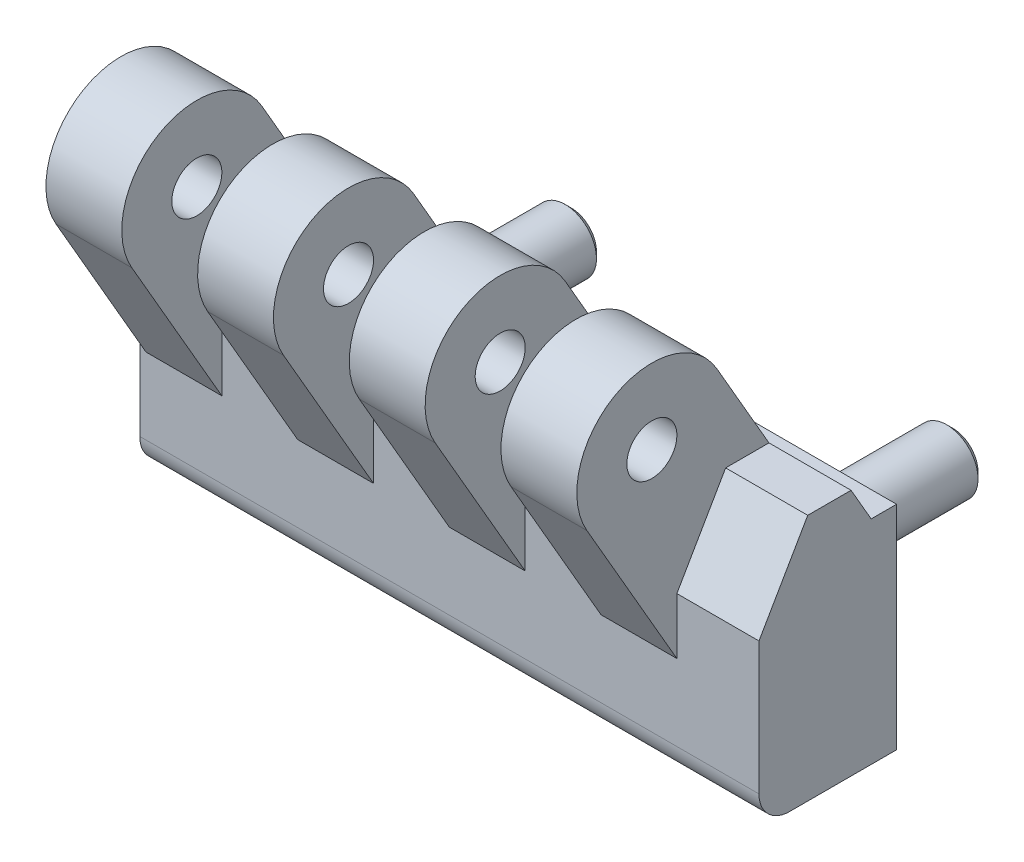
ISO-10303-21;
HEADER;
FILE_DESCRIPTION(('STEP AP214'),'2;1');
FILE_NAME('part.step','',(''),(''),'','','');
FILE_SCHEMA(('AUTOMOTIVE_DESIGN { 1 0 10303 214 1 1 1 1 }'));
ENDSEC;
DATA;
#1=APPLICATION_CONTEXT('core data for automotive mechanical design processes');
#2=APPLICATION_PROTOCOL_DEFINITION('international standard','automotive_design',2000,#1);
#3=PRODUCT_CONTEXT('',#1,'mechanical');
#4=PRODUCT('Part','Part','',(#3));
#5=PRODUCT_RELATED_PRODUCT_CATEGORY('part','',(#4));
#6=PRODUCT_DEFINITION_FORMATION('','',#4);
#7=PRODUCT_DEFINITION_CONTEXT('part definition',#1,'design');
#8=PRODUCT_DEFINITION('design','',#6,#7);
#9=PRODUCT_DEFINITION_SHAPE('','',#8);
#10=(LENGTH_UNIT() NAMED_UNIT(*) SI_UNIT(.MILLI.,.METRE.));
#11=(NAMED_UNIT(*) PLANE_ANGLE_UNIT() SI_UNIT($,.RADIAN.));
#12=(NAMED_UNIT(*) SI_UNIT($,.STERADIAN.) SOLID_ANGLE_UNIT());
#13=UNCERTAINTY_MEASURE_WITH_UNIT(LENGTH_MEASURE(1.E-05),#10,'distance_accuracy_value','');
#14=(GEOMETRIC_REPRESENTATION_CONTEXT(3) GLOBAL_UNCERTAINTY_ASSIGNED_CONTEXT((#13)) GLOBAL_UNIT_ASSIGNED_CONTEXT((#10,
#11,#12)) REPRESENTATION_CONTEXT('',''));
#15=CARTESIAN_POINT('',(0.,0.,0.));
#16=DIRECTION('',(0.,0.,1.));
#17=DIRECTION('',(1.,0.,0.));
#18=AXIS2_PLACEMENT_3D('',#15,#16,#17);
#19=CARTESIAN_POINT('',(-9.5,11.2857142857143,3.6386777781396));
#20=DIRECTION('',(0.,1.,0.));
#21=DIRECTION('',(-1.,0.,0.));
#22=AXIS2_PLACEMENT_3D('',#19,#20,#21);
#23=PLANE('',#22);
#24=DIRECTION('',(1.,0.,0.));
#25=VECTOR('',#24,1.);
#26=CARTESIAN_POINT('',(-9.5,11.2857142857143,7.1027793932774));
#27=LINE('',#26,#25);
#28=CARTESIAN_POINT('',(21.3125,11.2857142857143,7.1027793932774));
#29=VERTEX_POINT('',#28);
#30=CARTESIAN_POINT('',(27.375,11.2857142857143,7.1027793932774));
#31=VERTEX_POINT('',#30);
#32=EDGE_CURVE('E471',#29,#31,#27,.T.);
#33=ORIENTED_EDGE('',*,*,#32,.T.);
#34=DIRECTION('',(0.,0.,-1.));
#35=VECTOR('',#34,1.);
#36=CARTESIAN_POINT('',(27.375,11.2857142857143,3.6386777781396));
#37=LINE('',#36,#35);
#38=CARTESIAN_POINT('',(27.375,11.2857142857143,3.63867777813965));
#39=VERTEX_POINT('',#38);
#40=EDGE_CURVE('E29',#31,#39,#37,.T.);
#41=ORIENTED_EDGE('',*,*,#40,.T.);
#42=DIRECTION('',(1.,0.,0.));
#43=VECTOR('',#42,1.);
#44=CARTESIAN_POINT('',(-9.5,11.2857142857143,3.6386777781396));
#45=LINE('',#44,#43);
#46=CARTESIAN_POINT('',(21.3125,11.2857142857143,3.63867777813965));
#47=VERTEX_POINT('',#46);
#48=EDGE_CURVE('E232',#47,#39,#45,.T.);
#49=ORIENTED_EDGE('',*,*,#48,.F.);
#50=DIRECTION('',(0.,0.,-1.));
#51=VECTOR('',#50,1.);
#52=CARTESIAN_POINT('',(21.3125,11.2857142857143,3.6386777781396));
#53=LINE('',#52,#51);
#54=EDGE_CURVE('E405',#29,#47,#53,.T.);
#55=ORIENTED_EDGE('',*,*,#54,.F.);
#56=EDGE_LOOP('',(#33,#41,#49,#55));
#57=FACE_BOUND('',#56,.T.);
#58=ADVANCED_FACE('F14',(#57),#23,.T.);
#59=CARTESIAN_POINT('',(-9.5,11.2857142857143,7.1027793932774));
#60=DIRECTION('',(0.,0.49999999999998,0.86602540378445));
#61=DIRECTION('',(0.,-0.86602540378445,0.499999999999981));
#62=AXIS2_PLACEMENT_3D('',#59,#60,#61);
#63=PLANE('',#62);
#64=DIRECTION('',(1.,0.,0.));
#65=VECTOR('',#64,1.);
#66=CARTESIAN_POINT('',(-9.5,4.535530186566,11.));
#67=LINE('',#66,#65);
#68=CARTESIAN_POINT('',(21.3125,4.535530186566,11.));
#69=VERTEX_POINT('',#68);
#70=CARTESIAN_POINT('',(27.375,4.535530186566,11.));
#71=VERTEX_POINT('',#70);
#72=EDGE_CURVE('E465',#69,#71,#67,.T.);
#73=ORIENTED_EDGE('',*,*,#72,.T.);
#74=DIRECTION('',(0.,0.86602540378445,-0.499999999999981));
#75=VECTOR('',#74,1.);
#76=CARTESIAN_POINT('',(27.375,11.2857142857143,7.1027793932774));
#77=LINE('',#76,#75);
#78=EDGE_CURVE('E502',#71,#31,#77,.T.);
#79=ORIENTED_EDGE('',*,*,#78,.T.);
#80=ORIENTED_EDGE('',*,*,#32,.F.);
#81=DIRECTION('',(0.,0.86602540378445,-0.499999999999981));
#82=VECTOR('',#81,1.);
#83=CARTESIAN_POINT('',(21.3125,11.2857142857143,7.1027793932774));
#84=LINE('',#83,#82);
#85=EDGE_CURVE('E403',#69,#29,#84,.T.);
#86=ORIENTED_EDGE('',*,*,#85,.F.);
#87=EDGE_LOOP('',(#73,#79,#80,#86));
#88=FACE_BOUND('',#87,.T.);
#89=ADVANCED_FACE('F630',(#88),#63,.T.);
#90=CARTESIAN_POINT('',(-9.5,11.2857142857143,7.1027793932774));
#91=VERTEX_POINT('',#90);
#92=CARTESIAN_POINT('',(-9.,11.2857142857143,7.1027793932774));
#93=VERTEX_POINT('',#92);
#94=EDGE_CURVE('E466',#91,#93,#27,.T.);
#95=ORIENTED_EDGE('',*,*,#94,.T.);
#96=DIRECTION('',(0.,0.,-1.));
#97=VECTOR('',#96,1.);
#98=CARTESIAN_POINT('',(-9.,11.2857142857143,3.6386777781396));
#99=LINE('',#98,#97);
#100=CARTESIAN_POINT('',(-9.,11.2857142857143,3.6386777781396));
#101=VERTEX_POINT('',#100);
#102=EDGE_CURVE('E322',#93,#101,#99,.T.);
#103=ORIENTED_EDGE('',*,*,#102,.T.);
#104=CARTESIAN_POINT('',(-9.5,11.2857142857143,3.6386777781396));
#105=VERTEX_POINT('',#104);
#106=EDGE_CURVE('E472',#105,#101,#45,.T.);
#107=ORIENTED_EDGE('',*,*,#106,.F.);
#108=DIRECTION('',(0.,0.,1.));
#109=VECTOR('',#108,1.);
#110=CARTESIAN_POINT('',(-9.5,11.2857142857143,3.6386777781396));
#111=LINE('',#110,#109);
#112=EDGE_CURVE('E441',#105,#91,#111,.T.);
#113=ORIENTED_EDGE('',*,*,#112,.T.);
#114=EDGE_LOOP('',(#95,#103,#107,#113));
#115=FACE_BOUND('',#114,.T.);
#116=ADVANCED_FACE('F574',(#115),#23,.T.);
#117=CARTESIAN_POINT('',(-9.5,4.535530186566,11.));
#118=VERTEX_POINT('',#117);
#119=CARTESIAN_POINT('',(-9.,4.535530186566,11.));
#120=VERTEX_POINT('',#119);
#121=EDGE_CURVE('E460',#118,#120,#67,.T.);
#122=ORIENTED_EDGE('',*,*,#121,.T.);
#123=DIRECTION('',(0.,0.86602540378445,-0.499999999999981));
#124=VECTOR('',#123,1.);
#125=CARTESIAN_POINT('',(-9.,11.2857142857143,7.1027793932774));
#126=LINE('',#125,#124);
#127=EDGE_CURVE('E320',#120,#93,#126,.T.);
#128=ORIENTED_EDGE('',*,*,#127,.T.);
#129=ORIENTED_EDGE('',*,*,#94,.F.);
#130=DIRECTION('',(0.,-0.86602540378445,0.49999999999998));
#131=VECTOR('',#130,1.);
#132=CARTESIAN_POINT('',(-9.5,11.2857142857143,7.1027793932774));
#133=LINE('',#132,#131);
#134=EDGE_CURVE('E444',#91,#118,#133,.T.);
#135=ORIENTED_EDGE('',*,*,#134,.T.);
#136=EDGE_LOOP('',(#122,#128,#129,#135));
#137=FACE_BOUND('',#136,.T.);
#138=ADVANCED_FACE('F638',(#137),#63,.T.);
#139=CARTESIAN_POINT('',(-9.5,4.535530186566,11.));
#140=DIRECTION('',(0.,0.,1.));
#141=DIRECTION('',(1.,0.,0.));
#142=AXIS2_PLACEMENT_3D('',#139,#140,#141);
#143=PLANE('',#142);
#144=DIRECTION('',(0.,1.,0.));
#145=VECTOR('',#144,1.);
#146=CARTESIAN_POINT('',(33.4375,4.535530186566,11.));
#147=LINE('',#146,#145);
#148=CARTESIAN_POINT('',(33.4375,0.0358983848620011,11.));
#149=VERTEX_POINT('',#148);
#150=CARTESIAN_POINT('',(33.4375,4.535530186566,11.));
#151=VERTEX_POINT('',#150);
#152=EDGE_CURVE('E278',#149,#151,#147,.T.);
#153=ORIENTED_EDGE('',*,*,#152,.F.);
#154=DIRECTION('',(-1.,0.,0.));
#155=VECTOR('',#154,1.);
#156=CARTESIAN_POINT('',(-9.5,0.0358983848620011,11.));
#157=LINE('',#156,#155);
#158=CARTESIAN_POINT('',(27.375,0.0358983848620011,11.));
#159=VERTEX_POINT('',#158);
#160=EDGE_CURVE('E506',#149,#159,#157,.T.);
#161=ORIENTED_EDGE('',*,*,#160,.T.);
#162=DIRECTION('',(0.,1.,0.));
#163=VECTOR('',#162,1.);
#164=CARTESIAN_POINT('',(27.375,4.535530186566,11.));
#165=LINE('',#164,#163);
#166=EDGE_CURVE('E273',#159,#71,#165,.T.);
#167=ORIENTED_EDGE('',*,*,#166,.T.);
#168=ORIENTED_EDGE('',*,*,#72,.F.);
#169=DIRECTION('',(0.,1.,0.));
#170=VECTOR('',#169,1.);
#171=CARTESIAN_POINT('',(21.3125,4.535530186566,11.));
#172=LINE('',#171,#170);
#173=CARTESIAN_POINT('',(21.3125,0.0358983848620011,11.));
#174=VERTEX_POINT('',#173);
#175=EDGE_CURVE('E488',#174,#69,#172,.T.);
#176=ORIENTED_EDGE('',*,*,#175,.F.);
#177=DIRECTION('',(-1.,0.,0.));
#178=VECTOR('',#177,1.);
#179=CARTESIAN_POINT('',(-9.5,0.0358983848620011,11.));
#180=LINE('',#179,#178);
#181=CARTESIAN_POINT('',(15.25,0.0358983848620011,11.));
#182=VERTEX_POINT('',#181);
#183=EDGE_CURVE('E485',#174,#182,#180,.T.);
#184=ORIENTED_EDGE('',*,*,#183,.T.);
#185=DIRECTION('',(0.,1.,0.));
#186=VECTOR('',#185,1.);
#187=CARTESIAN_POINT('',(15.25,4.535530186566,11.));
#188=LINE('',#187,#186);
#189=CARTESIAN_POINT('',(15.25,4.535530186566,11.));
#190=VERTEX_POINT('',#189);
#191=EDGE_CURVE('E482',#182,#190,#188,.T.);
#192=ORIENTED_EDGE('',*,*,#191,.T.);
#193=CARTESIAN_POINT('',(9.1875,4.535530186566,11.));
#194=VERTEX_POINT('',#193);
#195=EDGE_CURVE('E552',#194,#190,#67,.T.);
#196=ORIENTED_EDGE('',*,*,#195,.F.);
#197=DIRECTION('',(0.,1.,0.));
#198=VECTOR('',#197,1.);
#199=CARTESIAN_POINT('',(9.1875,4.535530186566,11.));
#200=LINE('',#199,#198);
#201=CARTESIAN_POINT('',(9.1875,0.0358983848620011,11.));
#202=VERTEX_POINT('',#201);
#203=EDGE_CURVE('E490',#202,#194,#200,.T.);
#204=ORIENTED_EDGE('',*,*,#203,.F.);
#205=DIRECTION('',(1.,0.,0.));
#206=VECTOR('',#205,1.);
#207=CARTESIAN_POINT('',(-9.5,0.0358983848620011,11.));
#208=LINE('',#207,#206);
#209=CARTESIAN_POINT('',(3.125,0.0358983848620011,11.));
#210=VERTEX_POINT('',#209);
#211=EDGE_CURVE('E493',#210,#202,#208,.T.);
#212=ORIENTED_EDGE('',*,*,#211,.F.);
#213=DIRECTION('',(0.,1.,0.));
#214=VECTOR('',#213,1.);
#215=CARTESIAN_POINT('',(3.125,4.535530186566,11.));
#216=LINE('',#215,#214);
#217=CARTESIAN_POINT('',(3.125,4.535530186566,11.));
#218=VERTEX_POINT('',#217);
#219=EDGE_CURVE('E496',#210,#218,#216,.T.);
#220=ORIENTED_EDGE('',*,*,#219,.T.);
#221=CARTESIAN_POINT('',(-2.9375,4.535530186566,11.));
#222=VERTEX_POINT('',#221);
#223=EDGE_CURVE('E464',#222,#218,#67,.T.);
#224=ORIENTED_EDGE('',*,*,#223,.F.);
#225=DIRECTION('',(0.,1.,0.));
#226=VECTOR('',#225,1.);
#227=CARTESIAN_POINT('',(-2.9375,4.535530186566,11.));
#228=LINE('',#227,#226);
#229=CARTESIAN_POINT('',(-2.9375,0.0358983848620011,11.));
#230=VERTEX_POINT('',#229);
#231=EDGE_CURVE('E311',#230,#222,#228,.T.);
#232=ORIENTED_EDGE('',*,*,#231,.F.);
#233=DIRECTION('',(1.,0.,0.));
#234=VECTOR('',#233,1.);
#235=CARTESIAN_POINT('',(-9.5,0.0358983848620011,11.));
#236=LINE('',#235,#234);
#237=CARTESIAN_POINT('',(-9.,0.0358983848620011,11.));
#238=VERTEX_POINT('',#237);
#239=EDGE_CURVE('E499',#238,#230,#236,.T.);
#240=ORIENTED_EDGE('',*,*,#239,.F.);
#241=DIRECTION('',(0.,1.,0.));
#242=VECTOR('',#241,1.);
#243=CARTESIAN_POINT('',(-9.,4.535530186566,11.));
#244=LINE('',#243,#242);
#245=EDGE_CURVE('E318',#238,#120,#244,.T.);
#246=ORIENTED_EDGE('',*,*,#245,.T.);
#247=ORIENTED_EDGE('',*,*,#121,.F.);
#248=DIRECTION('',(0.,-1.,0.));
#249=VECTOR('',#248,1.);
#250=CARTESIAN_POINT('',(-9.5,4.535530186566,11.));
#251=LINE('',#250,#249);
#252=CARTESIAN_POINT('',(-9.5,-6.055555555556,11.));
#253=VERTEX_POINT('',#252);
#254=EDGE_CURVE('E447',#118,#253,#251,.T.);
#255=ORIENTED_EDGE('',*,*,#254,.T.);
#256=DIRECTION('',(1.,0.,0.));
#257=VECTOR('',#256,1.);
#258=CARTESIAN_POINT('',(-9.5,-6.055555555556,11.));
#259=LINE('',#258,#257);
#260=CARTESIAN_POINT('',(40.,-6.055555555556,11.));
#261=VERTEX_POINT('',#260);
#262=EDGE_CURVE('E457',#253,#261,#259,.T.);
#263=ORIENTED_EDGE('',*,*,#262,.T.);
#264=DIRECTION('',(0.,-1.,0.));
#265=VECTOR('',#264,1.);
#266=CARTESIAN_POINT('',(40.,4.535530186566,11.));
#267=LINE('',#266,#265);
#268=CARTESIAN_POINT('',(40.,4.535530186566,11.));
#269=VERTEX_POINT('',#268);
#270=EDGE_CURVE('E423',#269,#261,#267,.T.);
#271=ORIENTED_EDGE('',*,*,#270,.F.);
#272=EDGE_CURVE('E459',#151,#269,#67,.T.);
#273=ORIENTED_EDGE('',*,*,#272,.F.);
#274=EDGE_LOOP('',(#153,#161,#167,#168,#176,#184,#192,#196,#204,#212,#220,#224,#232,#240,#246,
#247,#255,#263,#271,#273));
#275=FACE_BOUND('',#274,.T.);
#276=ADVANCED_FACE('F563',(#275),#143,.T.);
#277=DIRECTION('',(0.,0.,-1.));
#278=VECTOR('',#277,1.);
#279=CARTESIAN_POINT('',(-2.9375,11.2857142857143,3.6386777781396));
#280=LINE('',#279,#278);
#281=CARTESIAN_POINT('',(-2.9375,11.2857142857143,7.1027793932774));
#282=VERTEX_POINT('',#281);
#283=CARTESIAN_POINT('',(-2.9375,11.2857142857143,3.6386777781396));
#284=VERTEX_POINT('',#283);
#285=EDGE_CURVE('E37',#282,#284,#280,.T.);
#286=ORIENTED_EDGE('',*,*,#285,.F.);
#287=CARTESIAN_POINT('',(3.125,11.2857142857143,7.1027793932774));
#288=VERTEX_POINT('',#287);
#289=EDGE_CURVE('E470',#282,#288,#27,.T.);
#290=ORIENTED_EDGE('',*,*,#289,.T.);
#291=DIRECTION('',(0.,0.,-1.));
#292=VECTOR('',#291,1.);
#293=CARTESIAN_POINT('',(3.125,11.2857142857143,3.6386777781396));
#294=LINE('',#293,#292);
#295=CARTESIAN_POINT('',(3.125,11.2857142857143,3.6386777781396));
#296=VERTEX_POINT('',#295);
#297=EDGE_CURVE('E364',#288,#296,#294,.T.);
#298=ORIENTED_EDGE('',*,*,#297,.T.);
#299=EDGE_CURVE('E476',#284,#296,#45,.T.);
#300=ORIENTED_EDGE('',*,*,#299,.F.);
#301=EDGE_LOOP('',(#286,#290,#298,#300));
#302=FACE_BOUND('',#301,.T.);
#303=ADVANCED_FACE('F603',(#302),#23,.T.);
#304=DIRECTION('',(0.,0.86602540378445,-0.499999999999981));
#305=VECTOR('',#304,1.);
#306=CARTESIAN_POINT('',(-2.9375,11.2857142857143,7.1027793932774));
#307=LINE('',#306,#305);
#308=EDGE_CURVE('E314',#222,#282,#307,.T.);
#309=ORIENTED_EDGE('',*,*,#308,.F.);
#310=ORIENTED_EDGE('',*,*,#223,.T.);
#311=DIRECTION('',(0.,0.86602540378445,-0.499999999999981));
#312=VECTOR('',#311,1.);
#313=CARTESIAN_POINT('',(3.125,11.2857142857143,7.1027793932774));
#314=LINE('',#313,#312);
#315=EDGE_CURVE('E361',#218,#288,#314,.T.);
#316=ORIENTED_EDGE('',*,*,#315,.T.);
#317=ORIENTED_EDGE('',*,*,#289,.F.);
#318=EDGE_LOOP('',(#309,#310,#316,#317));
#319=FACE_BOUND('',#318,.T.);
#320=ADVANCED_FACE('F594',(#319),#63,.T.);
#321=DIRECTION('',(0.,0.,-1.));
#322=VECTOR('',#321,1.);
#323=CARTESIAN_POINT('',(9.1875,11.2857142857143,3.6386777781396));
#324=LINE('',#323,#322);
#325=CARTESIAN_POINT('',(9.1875,11.2857142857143,7.1027793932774));
#326=VERTEX_POINT('',#325);
#327=CARTESIAN_POINT('',(9.1875,11.2857142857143,3.6386777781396));
#328=VERTEX_POINT('',#327);
#329=EDGE_CURVE('E358',#326,#328,#324,.T.);
#330=ORIENTED_EDGE('',*,*,#329,.F.);
#331=CARTESIAN_POINT('',(15.25,11.2857142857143,7.1027793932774));
#332=VERTEX_POINT('',#331);
#333=EDGE_CURVE('E538',#326,#332,#27,.T.);
#334=ORIENTED_EDGE('',*,*,#333,.T.);
#335=DIRECTION('',(0.,0.,-1.));
#336=VECTOR('',#335,1.);
#337=CARTESIAN_POINT('',(15.25,11.2857142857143,3.6386777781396));
#338=LINE('',#337,#336);
#339=CARTESIAN_POINT('',(15.25,11.2857142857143,3.63867777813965));
#340=VERTEX_POINT('',#339);
#341=EDGE_CURVE('E400',#332,#340,#338,.T.);
#342=ORIENTED_EDGE('',*,*,#341,.T.);
#343=EDGE_CURVE('E604',#328,#340,#45,.T.);
#344=ORIENTED_EDGE('',*,*,#343,.F.);
#345=EDGE_LOOP('',(#330,#334,#342,#344));
#346=FACE_BOUND('',#345,.T.);
#347=ADVANCED_FACE('F542',(#346),#23,.T.);
#348=DIRECTION('',(0.,0.86602540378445,-0.499999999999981));
#349=VECTOR('',#348,1.);
#350=CARTESIAN_POINT('',(9.1875,11.2857142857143,7.1027793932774));
#351=LINE('',#350,#349);
#352=EDGE_CURVE('E355',#194,#326,#351,.T.);
#353=ORIENTED_EDGE('',*,*,#352,.F.);
#354=ORIENTED_EDGE('',*,*,#195,.T.);
#355=DIRECTION('',(0.,0.86602540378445,-0.499999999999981));
#356=VECTOR('',#355,1.);
#357=CARTESIAN_POINT('',(15.25,11.2857142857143,7.1027793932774));
#358=LINE('',#357,#356);
#359=EDGE_CURVE('E397',#190,#332,#358,.T.);
#360=ORIENTED_EDGE('',*,*,#359,.T.);
#361=ORIENTED_EDGE('',*,*,#333,.F.);
#362=EDGE_LOOP('',(#353,#354,#360,#361));
#363=FACE_BOUND('',#362,.T.);
#364=ADVANCED_FACE('F551',(#363),#63,.T.);
#365=CARTESIAN_POINT('',(-9.5,-8.5,8.5555555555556));
#366=DIRECTION('',(0.,-1.,0.));
#367=DIRECTION('',(1.,0.,0.));
#368=AXIS2_PLACEMENT_3D('',#365,#366,#367);
#369=PLANE('',#368);
#370=DIRECTION('',(1.,0.,0.));
#371=VECTOR('',#370,1.);
#372=CARTESIAN_POINT('',(-9.5,-8.5,0.));
#373=LINE('',#372,#371);
#374=CARTESIAN_POINT('',(-9.5,-8.5,0.));
#375=VERTEX_POINT('',#374);
#376=CARTESIAN_POINT('',(40.,-8.5,0.));
#377=VERTEX_POINT('',#376);
#378=EDGE_CURVE('E480',#375,#377,#373,.T.);
#379=ORIENTED_EDGE('',*,*,#378,.T.);
#380=DIRECTION('',(0.,0.,-1.));
#381=VECTOR('',#380,1.);
#382=CARTESIAN_POINT('',(40.,-8.5,8.5555555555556));
#383=LINE('',#382,#381);
#384=CARTESIAN_POINT('',(40.,-8.5,8.5555555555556));
#385=VERTEX_POINT('',#384);
#386=EDGE_CURVE('E407',#385,#377,#383,.T.);
#387=ORIENTED_EDGE('',*,*,#386,.F.);
#388=DIRECTION('',(1.,0.,0.));
#389=VECTOR('',#388,1.);
#390=CARTESIAN_POINT('',(-9.5,-8.5,8.5555555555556));
#391=LINE('',#390,#389);
#392=CARTESIAN_POINT('',(-9.5,-8.5,8.5555555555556));
#393=VERTEX_POINT('',#392);
#394=EDGE_CURVE('E453',#393,#385,#391,.T.);
#395=ORIENTED_EDGE('',*,*,#394,.F.);
#396=DIRECTION('',(0.,0.,-1.));
#397=VECTOR('',#396,1.);
#398=CARTESIAN_POINT('',(-9.5,-8.5,8.5555555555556));
#399=LINE('',#398,#397);
#400=EDGE_CURVE('E429',#393,#375,#399,.T.);
#401=ORIENTED_EDGE('',*,*,#400,.T.);
#402=EDGE_LOOP('',(#379,#387,#395,#401));
#403=FACE_BOUND('',#402,.T.);
#404=ADVANCED_FACE('F16',(#403),#369,.T.);
#405=CARTESIAN_POINT('',(-9.5,-8.5,0.));
#406=DIRECTION('',(0.,0.,-1.));
#407=DIRECTION('',(-1.,0.,0.));
#408=AXIS2_PLACEMENT_3D('',#405,#406,#407);
#409=PLANE('',#408);
#410=CARTESIAN_POINT('',(0.,0.,0.));
#411=DIRECTION('',(0.,0.,-1.));
#412=DIRECTION('',(-1.,0.,0.));
#413=AXIS2_PLACEMENT_3D('',#410,#411,#412);
#414=CIRCLE('',#413,2.5);
#415=CARTESIAN_POINT('',(-2.5,0.,0.));
#416=VERTEX_POINT('',#415);
#417=EDGE_CURVE('E9',#416,#416,#414,.T.);
#418=ORIENTED_EDGE('',*,*,#417,.F.);
#419=EDGE_LOOP('',(#418));
#420=FACE_BOUND('',#419,.T.);
#421=CARTESIAN_POINT('',(30.5,0.,0.));
#422=DIRECTION('',(0.,0.,-1.));
#423=DIRECTION('',(-1.,0.,0.));
#424=AXIS2_PLACEMENT_3D('',#421,#422,#423);
#425=CIRCLE('',#424,2.5);
#426=CARTESIAN_POINT('',(28.,0.,0.));
#427=VERTEX_POINT('',#426);
#428=EDGE_CURVE('E22',#427,#427,#425,.T.);
#429=ORIENTED_EDGE('',*,*,#428,.F.);
#430=EDGE_LOOP('',(#429));
#431=FACE_BOUND('',#430,.T.);
#432=DIRECTION('',(1.,0.,0.));
#433=VECTOR('',#432,1.);
#434=CARTESIAN_POINT('',(-9.5,8.5,0.));
#435=LINE('',#434,#433);
#436=CARTESIAN_POINT('',(-9.5,8.5,0.));
#437=VERTEX_POINT('',#436);
#438=CARTESIAN_POINT('',(40.,8.5,0.));
#439=VERTEX_POINT('',#438);
#440=EDGE_CURVE('E478',#437,#439,#435,.T.);
#441=ORIENTED_EDGE('',*,*,#440,.T.);
#442=DIRECTION('',(0.,1.,0.));
#443=VECTOR('',#442,1.);
#444=CARTESIAN_POINT('',(40.,-8.5,0.));
#445=LINE('',#444,#443);
#446=EDGE_CURVE('E408',#377,#439,#445,.T.);
#447=ORIENTED_EDGE('',*,*,#446,.F.);
#448=ORIENTED_EDGE('',*,*,#378,.F.);
#449=DIRECTION('',(0.,1.,0.));
#450=VECTOR('',#449,1.);
#451=CARTESIAN_POINT('',(-9.5,-8.5,0.));
#452=LINE('',#451,#450);
#453=EDGE_CURVE('E432',#375,#437,#452,.T.);
#454=ORIENTED_EDGE('',*,*,#453,.T.);
#455=EDGE_LOOP('',(#441,#447,#448,#454));
#456=FACE_BOUND('',#455,.T.);
#457=ADVANCED_FACE('F513',(#420,#431,#456),#409,.T.);
#458=CARTESIAN_POINT('',(-9.5,8.5,0.));
#459=DIRECTION('',(0.,1.,0.));
#460=DIRECTION('',(-1.,0.,0.));
#461=AXIS2_PLACEMENT_3D('',#458,#459,#460);
#462=PLANE('',#461);
#463=DIRECTION('',(1.,0.,0.));
#464=VECTOR('',#463,1.);
#465=CARTESIAN_POINT('',(-9.5,8.5,2.0303448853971));
#466=LINE('',#465,#464);
#467=CARTESIAN_POINT('',(-9.5,8.5,2.0303448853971));
#468=VERTEX_POINT('',#467);
#469=CARTESIAN_POINT('',(40.,8.5,2.0303448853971));
#470=VERTEX_POINT('',#469);
#471=EDGE_CURVE('E475',#468,#470,#466,.T.);
#472=ORIENTED_EDGE('',*,*,#471,.T.);
#473=DIRECTION('',(0.,0.,1.));
#474=VECTOR('',#473,1.);
#475=CARTESIAN_POINT('',(40.,8.5,0.));
#476=LINE('',#475,#474);
#477=EDGE_CURVE('E411',#439,#470,#476,.T.);
#478=ORIENTED_EDGE('',*,*,#477,.F.);
#479=ORIENTED_EDGE('',*,*,#440,.F.);
#480=DIRECTION('',(0.,0.,1.));
#481=VECTOR('',#480,1.);
#482=CARTESIAN_POINT('',(-9.5,8.5,0.));
#483=LINE('',#482,#481);
#484=EDGE_CURVE('E435',#437,#468,#483,.T.);
#485=ORIENTED_EDGE('',*,*,#484,.T.);
#486=EDGE_LOOP('',(#472,#478,#479,#485));
#487=FACE_BOUND('',#486,.T.);
#488=ADVANCED_FACE('F516',(#487),#462,.T.);
#489=CARTESIAN_POINT('',(-9.5,8.5,2.0303448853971));
#490=DIRECTION('',(0.,0.499999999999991,-0.866025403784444));
#491=DIRECTION('',(0.,0.866025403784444,0.499999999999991));
#492=AXIS2_PLACEMENT_3D('',#489,#490,#491);
#493=PLANE('',#492);
#494=DIRECTION('',(0.,0.866025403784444,0.499999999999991));
#495=VECTOR('',#494,1.);
#496=CARTESIAN_POINT('',(40.,8.5,2.0303448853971));
#497=LINE('',#496,#495);
#498=CARTESIAN_POINT('',(40.,11.2857142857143,3.6386777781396));
#499=VERTEX_POINT('',#498);
#500=EDGE_CURVE('E414',#470,#499,#497,.T.);
#501=ORIENTED_EDGE('',*,*,#500,.F.);
#502=ORIENTED_EDGE('',*,*,#471,.F.);
#503=DIRECTION('',(0.,0.866025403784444,0.499999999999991));
#504=VECTOR('',#503,1.);
#505=CARTESIAN_POINT('',(-9.5,8.5,2.0303448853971));
#506=LINE('',#505,#504);
#507=EDGE_CURVE('E438',#468,#105,#506,.T.);
#508=ORIENTED_EDGE('',*,*,#507,.T.);
#509=ORIENTED_EDGE('',*,*,#106,.T.);
#510=DIRECTION('',(0.,0.866025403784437,0.5));
#511=VECTOR('',#510,1.);
#512=CARTESIAN_POINT('',(-9.,6.7153903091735,1.));
#513=LINE('',#512,#511);
#514=CARTESIAN_POINT('',(-9.,18.5,7.8038475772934));
#515=VERTEX_POINT('',#514);
#516=EDGE_CURVE('E296',#101,#515,#513,.T.);
#517=ORIENTED_EDGE('',*,*,#516,.T.);
#518=DIRECTION('',(1.,0.,0.));
#519=VECTOR('',#518,1.);
#520=CARTESIAN_POINT('',(-9.,18.5,7.8038475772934));
#521=LINE('',#520,#519);
#522=CARTESIAN_POINT('',(-2.9375,18.5,7.8038475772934));
#523=VERTEX_POINT('',#522);
#524=EDGE_CURVE('E308',#515,#523,#521,.T.);
#525=ORIENTED_EDGE('',*,*,#524,.T.);
#526=DIRECTION('',(0.,0.866025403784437,0.5));
#527=VECTOR('',#526,1.);
#528=CARTESIAN_POINT('',(-2.9375,6.7153903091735,1.));
#529=LINE('',#528,#527);
#530=EDGE_CURVE('E281',#284,#523,#529,.T.);
#531=ORIENTED_EDGE('',*,*,#530,.F.);
#532=ORIENTED_EDGE('',*,*,#299,.T.);
#533=DIRECTION('',(0.,0.866025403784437,0.5));
#534=VECTOR('',#533,1.);
#535=CARTESIAN_POINT('',(3.125,6.7153903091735,1.));
#536=LINE('',#535,#534);
#537=CARTESIAN_POINT('',(3.125,18.5,7.8038475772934));
#538=VERTEX_POINT('',#537);
#539=EDGE_CURVE('E340',#296,#538,#536,.T.);
#540=ORIENTED_EDGE('',*,*,#539,.T.);
#541=DIRECTION('',(1.,0.,0.));
#542=VECTOR('',#541,1.);
#543=CARTESIAN_POINT('',(3.125,18.5,7.8038475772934));
#544=LINE('',#543,#542);
#545=CARTESIAN_POINT('',(9.1875,18.5,7.8038475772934));
#546=VERTEX_POINT('',#545);
#547=EDGE_CURVE('E352',#538,#546,#544,.T.);
#548=ORIENTED_EDGE('',*,*,#547,.T.);
#549=DIRECTION('',(0.,0.866025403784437,0.5));
#550=VECTOR('',#549,1.);
#551=CARTESIAN_POINT('',(9.1875,6.7153903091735,1.));
#552=LINE('',#551,#550);
#553=EDGE_CURVE('E325',#328,#546,#552,.T.);
#554=ORIENTED_EDGE('',*,*,#553,.F.);
#555=ORIENTED_EDGE('',*,*,#343,.T.);
#556=DIRECTION('',(0.,0.866025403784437,0.5));
#557=VECTOR('',#556,1.);
#558=CARTESIAN_POINT('',(15.25,6.7153903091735,1.));
#559=LINE('',#558,#557);
#560=CARTESIAN_POINT('',(15.25,18.5,7.8038475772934));
#561=VERTEX_POINT('',#560);
#562=EDGE_CURVE('E368',#340,#561,#559,.T.);
#563=ORIENTED_EDGE('',*,*,#562,.T.);
#564=DIRECTION('',(-1.,0.,0.));
#565=VECTOR('',#564,1.);
#566=CARTESIAN_POINT('',(21.3125,18.5,7.8038475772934));
#567=LINE('',#566,#565);
#568=CARTESIAN_POINT('',(21.3125,18.5,7.8038475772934));
#569=VERTEX_POINT('',#568);
#570=EDGE_CURVE('E394',#569,#561,#567,.T.);
#571=ORIENTED_EDGE('',*,*,#570,.F.);
#572=DIRECTION('',(0.,0.866025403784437,0.5));
#573=VECTOR('',#572,1.);
#574=CARTESIAN_POINT('',(21.3125,6.7153903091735,1.));
#575=LINE('',#574,#573);
#576=EDGE_CURVE('E382',#47,#569,#575,.T.);
#577=ORIENTED_EDGE('',*,*,#576,.F.);
#578=ORIENTED_EDGE('',*,*,#48,.T.);
#579=DIRECTION('',(0.,0.866025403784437,0.5));
#580=VECTOR('',#579,1.);
#581=CARTESIAN_POINT('',(27.375,6.7153903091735,1.));
#582=LINE('',#581,#580);
#583=CARTESIAN_POINT('',(27.375,18.5,7.8038475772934));
#584=VERTEX_POINT('',#583);
#585=EDGE_CURVE('E223',#39,#584,#582,.T.);
#586=ORIENTED_EDGE('',*,*,#585,.T.);
#587=DIRECTION('',(-1.,0.,0.));
#588=VECTOR('',#587,1.);
#589=CARTESIAN_POINT('',(33.4375,18.5,7.8038475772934));
#590=LINE('',#589,#588);
#591=CARTESIAN_POINT('',(33.4375,18.5,7.8038475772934));
#592=VERTEX_POINT('',#591);
#593=EDGE_CURVE('E228',#592,#584,#590,.T.);
#594=ORIENTED_EDGE('',*,*,#593,.F.);
#595=DIRECTION('',(0.,0.866025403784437,0.5));
#596=VECTOR('',#595,1.);
#597=CARTESIAN_POINT('',(33.4375,6.7153903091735,1.));
#598=LINE('',#597,#596);
#599=CARTESIAN_POINT('',(33.4375,11.2857142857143,3.63867777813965));
#600=VERTEX_POINT('',#599);
#601=EDGE_CURVE('E263',#600,#592,#598,.T.);
#602=ORIENTED_EDGE('',*,*,#601,.F.);
#603=EDGE_CURVE('E469',#600,#499,#45,.T.);
#604=ORIENTED_EDGE('',*,*,#603,.T.);
#605=EDGE_LOOP('',(#501,#502,#508,#509,#517,#525,#531,#532,#540,#548,#554,#555,#563,#571,#577,
#578,#586,#594,#602,#604));
#606=FACE_BOUND('',#605,.T.);
#607=ADVANCED_FACE('F226',(#606),#493,.T.);
#608=DIRECTION('',(0.,0.,-1.));
#609=VECTOR('',#608,1.);
#610=CARTESIAN_POINT('',(33.4375,11.2857142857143,3.6386777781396));
#611=LINE('',#610,#609);
#612=CARTESIAN_POINT('',(33.4375,11.2857142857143,7.1027793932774));
#613=VERTEX_POINT('',#612);
#614=EDGE_CURVE('E276',#613,#600,#611,.T.);
#615=ORIENTED_EDGE('',*,*,#614,.F.);
#616=CARTESIAN_POINT('',(40.,11.2857142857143,7.1027793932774));
#617=VERTEX_POINT('',#616);
#618=EDGE_CURVE('E463',#613,#617,#27,.T.);
#619=ORIENTED_EDGE('',*,*,#618,.T.);
#620=DIRECTION('',(0.,0.,1.));
#621=VECTOR('',#620,1.);
#622=CARTESIAN_POINT('',(40.,11.2857142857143,3.6386777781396));
#623=LINE('',#622,#621);
#624=EDGE_CURVE('E417',#499,#617,#623,.T.);
#625=ORIENTED_EDGE('',*,*,#624,.F.);
#626=ORIENTED_EDGE('',*,*,#603,.F.);
#627=EDGE_LOOP('',(#615,#619,#625,#626));
#628=FACE_BOUND('',#627,.T.);
#629=ADVANCED_FACE('F533',(#628),#23,.T.);
#630=DIRECTION('',(0.,0.86602540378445,-0.499999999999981));
#631=VECTOR('',#630,1.);
#632=CARTESIAN_POINT('',(33.4375,11.2857142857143,7.1027793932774));
#633=LINE('',#632,#631);
#634=EDGE_CURVE('E504',#151,#613,#633,.T.);
#635=ORIENTED_EDGE('',*,*,#634,.F.);
#636=ORIENTED_EDGE('',*,*,#272,.T.);
#637=DIRECTION('',(0.,-0.86602540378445,0.49999999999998));
#638=VECTOR('',#637,1.);
#639=CARTESIAN_POINT('',(40.,11.2857142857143,7.1027793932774));
#640=LINE('',#639,#638);
#641=EDGE_CURVE('E420',#617,#269,#640,.T.);
#642=ORIENTED_EDGE('',*,*,#641,.F.);
#643=ORIENTED_EDGE('',*,*,#618,.F.);
#644=EDGE_LOOP('',(#635,#636,#642,#643));
#645=FACE_BOUND('',#644,.T.);
#646=ADVANCED_FACE('F559',(#645),#63,.T.);
#647=CARTESIAN_POINT('',(-9.5,-6.05555555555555,8.55555555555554));
#648=DIRECTION('',(1.,0.,0.));
#649=DIRECTION('',(0.,1.,0.));
#650=AXIS2_PLACEMENT_3D('',#647,#648,#649);
#651=CYLINDRICAL_SURFACE('',#650,2.44444444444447);
#652=ORIENTED_EDGE('',*,*,#394,.T.);
#653=CARTESIAN_POINT('',(40.,-6.05555555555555,8.55555555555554));
#654=DIRECTION('',(1.,0.,0.));
#655=DIRECTION('',(0.,1.,0.));
#656=AXIS2_PLACEMENT_3D('',#653,#654,#655);
#657=CIRCLE('',#656,2.44444444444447);
#658=EDGE_CURVE('E426',#261,#385,#657,.T.);
#659=ORIENTED_EDGE('',*,*,#658,.F.);
#660=ORIENTED_EDGE('',*,*,#262,.F.);
#661=CARTESIAN_POINT('',(-9.5,-6.05555555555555,8.55555555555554));
#662=DIRECTION('',(1.,0.,0.));
#663=DIRECTION('',(0.,1.,0.));
#664=AXIS2_PLACEMENT_3D('',#661,#662,#663);
#665=CIRCLE('',#664,2.44444444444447);
#666=EDGE_CURVE('E450',#253,#393,#665,.T.);
#667=ORIENTED_EDGE('',*,*,#666,.T.);
#668=EDGE_LOOP('',(#652,#659,#660,#667));
#669=FACE_BOUND('',#668,.T.);
#670=ADVANCED_FACE('F567',(#669),#651,.T.);
#671=CARTESIAN_POINT('',(-9.5,-6.05555555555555,8.55555555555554));
#672=DIRECTION('',(1.,0.,0.));
#673=DIRECTION('',(0.,1.,0.));
#674=AXIS2_PLACEMENT_3D('',#671,#672,#673);
#675=PLANE('',#674);
#676=ORIENTED_EDGE('',*,*,#400,.F.);
#677=ORIENTED_EDGE('',*,*,#666,.F.);
#678=ORIENTED_EDGE('',*,*,#254,.F.);
#679=ORIENTED_EDGE('',*,*,#134,.F.);
#680=ORIENTED_EDGE('',*,*,#112,.F.);
#681=ORIENTED_EDGE('',*,*,#507,.F.);
#682=ORIENTED_EDGE('',*,*,#484,.F.);
#683=ORIENTED_EDGE('',*,*,#453,.F.);
#684=EDGE_LOOP('',(#676,#677,#678,#679,#680,#681,#682,#683));
#685=FACE_BOUND('',#684,.T.);
#686=ADVANCED_FACE('F571',(#685),#675,.F.);
#687=CARTESIAN_POINT('',(40.,-6.05555555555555,8.55555555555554));
#688=DIRECTION('',(1.,0.,0.));
#689=DIRECTION('',(0.,1.,0.));
#690=AXIS2_PLACEMENT_3D('',#687,#688,#689);
#691=PLANE('',#690);
#692=ORIENTED_EDGE('',*,*,#386,.T.);
#693=ORIENTED_EDGE('',*,*,#446,.T.);
#694=ORIENTED_EDGE('',*,*,#477,.T.);
#695=ORIENTED_EDGE('',*,*,#500,.T.);
#696=ORIENTED_EDGE('',*,*,#624,.T.);
#697=ORIENTED_EDGE('',*,*,#641,.T.);
#698=ORIENTED_EDGE('',*,*,#270,.T.);
#699=ORIENTED_EDGE('',*,*,#658,.T.);
#700=EDGE_LOOP('',(#692,#693,#694,#695,#696,#697,#698,#699));
#701=FACE_BOUND('',#700,.T.);
#702=ADVANCED_FACE('F524',(#701),#691,.T.);
#703=CARTESIAN_POINT('',(21.3125,12.5,18.196152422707));
#704=DIRECTION('',(0.,0.500000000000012,-0.866025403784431));
#705=DIRECTION('',(0.,0.866025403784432,0.500000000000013));
#706=AXIS2_PLACEMENT_3D('',#703,#704,#705);
#707=PLANE('',#706);
#708=ORIENTED_EDGE('',*,*,#183,.F.);
#709=DIRECTION('',(0.,-0.866025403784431,-0.500000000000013));
#710=VECTOR('',#709,1.);
#711=CARTESIAN_POINT('',(21.3125,12.5,18.196152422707));
#712=LINE('',#711,#710);
#713=CARTESIAN_POINT('',(21.3125,12.5,18.196152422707));
#714=VERTEX_POINT('',#713);
#715=EDGE_CURVE('E381',#714,#174,#712,.T.);
#716=ORIENTED_EDGE('',*,*,#715,.F.);
#717=DIRECTION('',(-1.,0.,0.));
#718=VECTOR('',#717,1.);
#719=CARTESIAN_POINT('',(21.3125,12.5,18.196152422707));
#720=LINE('',#719,#718);
#721=CARTESIAN_POINT('',(15.25,12.5,18.196152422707));
#722=VERTEX_POINT('',#721);
#723=EDGE_CURVE('E391',#714,#722,#720,.T.);
#724=ORIENTED_EDGE('',*,*,#723,.T.);
#725=DIRECTION('',(0.,-0.866025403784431,-0.500000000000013));
#726=VECTOR('',#725,1.);
#727=CARTESIAN_POINT('',(15.25,12.5,18.196152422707));
#728=LINE('',#727,#726);
#729=EDGE_CURVE('E367',#722,#182,#728,.T.);
#730=ORIENTED_EDGE('',*,*,#729,.T.);
#731=EDGE_LOOP('',(#708,#716,#724,#730));
#732=FACE_BOUND('',#731,.T.);
#733=ADVANCED_FACE('F671',(#732),#707,.F.);
#734=CARTESIAN_POINT('',(21.3125,15.5,13.));
#735=DIRECTION('',(-1.,0.,0.));
#736=DIRECTION('',(0.,-1.,0.));
#737=AXIS2_PLACEMENT_3D('',#734,#735,#736);
#738=CYLINDRICAL_SURFACE('',#737,2.);
#739=CARTESIAN_POINT('',(21.3125,15.5,13.));
#740=DIRECTION('',(1.,0.,0.));
#741=DIRECTION('',(0.,1.,0.));
#742=AXIS2_PLACEMENT_3D('',#739,#740,#741);
#743=CIRCLE('',#742,2.);
#744=CARTESIAN_POINT('',(21.3125,17.5,13.));
#745=VERTEX_POINT('',#744);
#746=EDGE_CURVE('E386',#745,#745,#743,.T.);
#747=ORIENTED_EDGE('',*,*,#746,.T.);
#748=EDGE_LOOP('',(#747));
#749=FACE_BOUND('',#748,.T.);
#750=CARTESIAN_POINT('',(15.25,15.5,13.));
#751=DIRECTION('',(1.,0.,0.));
#752=DIRECTION('',(0.,1.,0.));
#753=AXIS2_PLACEMENT_3D('',#750,#751,#752);
#754=CIRCLE('',#753,2.);
#755=CARTESIAN_POINT('',(15.25,17.5,13.));
#756=VERTEX_POINT('',#755);
#757=EDGE_CURVE('E374',#756,#756,#754,.T.);
#758=ORIENTED_EDGE('',*,*,#757,.F.);
#759=EDGE_LOOP('',(#758));
#760=FACE_BOUND('',#759,.T.);
#761=ADVANCED_FACE('F674',(#749,#760),#738,.F.);
#762=CARTESIAN_POINT('',(21.3125,15.4999999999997,13.));
#763=DIRECTION('',(-1.,0.,0.));
#764=DIRECTION('',(0.,-1.,0.));
#765=AXIS2_PLACEMENT_3D('',#762,#763,#764);
#766=CYLINDRICAL_SURFACE('',#765,6.00000000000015);
#767=CARTESIAN_POINT('',(15.25,15.4999999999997,13.));
#768=DIRECTION('',(1.,0.,0.));
#769=DIRECTION('',(0.,-1.,0.));
#770=AXIS2_PLACEMENT_3D('',#767,#768,#769);
#771=CIRCLE('',#770,6.00000000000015);
#772=EDGE_CURVE('E371',#561,#722,#771,.T.);
#773=ORIENTED_EDGE('',*,*,#772,.T.);
#774=ORIENTED_EDGE('',*,*,#723,.F.);
#775=CARTESIAN_POINT('',(21.3125,15.4999999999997,13.));
#776=DIRECTION('',(1.,0.,0.));
#777=DIRECTION('',(0.,-1.,0.));
#778=AXIS2_PLACEMENT_3D('',#775,#776,#777);
#779=CIRCLE('',#778,6.00000000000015);
#780=EDGE_CURVE('E384',#569,#714,#779,.T.);
#781=ORIENTED_EDGE('',*,*,#780,.F.);
#782=ORIENTED_EDGE('',*,*,#570,.T.);
#783=EDGE_LOOP('',(#773,#774,#781,#782));
#784=FACE_BOUND('',#783,.T.);
#785=ADVANCED_FACE('F676',(#784),#766,.T.);
#786=CARTESIAN_POINT('',(21.3125,15.4999999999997,13.));
#787=DIRECTION('',(1.,0.,0.));
#788=DIRECTION('',(0.,1.,0.));
#789=AXIS2_PLACEMENT_3D('',#786,#787,#788);
#790=PLANE('',#789);
#791=ORIENTED_EDGE('',*,*,#746,.F.);
#792=EDGE_LOOP('',(#791));
#793=FACE_BOUND('',#792,.T.);
#794=ORIENTED_EDGE('',*,*,#85,.T.);
#795=ORIENTED_EDGE('',*,*,#54,.T.);
#796=ORIENTED_EDGE('',*,*,#576,.T.);
#797=ORIENTED_EDGE('',*,*,#780,.T.);
#798=ORIENTED_EDGE('',*,*,#715,.T.);
#799=ORIENTED_EDGE('',*,*,#175,.T.);
#800=EDGE_LOOP('',(#794,#795,#796,#797,#798,#799));
#801=FACE_BOUND('',#800,.T.);
#802=ADVANCED_FACE('F679',(#793,#801),#790,.T.);
#803=CARTESIAN_POINT('',(15.25,15.4999999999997,13.));
#804=DIRECTION('',(1.,0.,0.));
#805=DIRECTION('',(0.,1.,0.));
#806=AXIS2_PLACEMENT_3D('',#803,#804,#805);
#807=PLANE('',#806);
#808=ORIENTED_EDGE('',*,*,#341,.F.);
#809=ORIENTED_EDGE('',*,*,#359,.F.);
#810=ORIENTED_EDGE('',*,*,#191,.F.);
#811=ORIENTED_EDGE('',*,*,#729,.F.);
#812=ORIENTED_EDGE('',*,*,#772,.F.);
#813=ORIENTED_EDGE('',*,*,#562,.F.);
#814=EDGE_LOOP('',(#808,#809,#810,#811,#812,#813));
#815=FACE_BOUND('',#814,.T.);
#816=ORIENTED_EDGE('',*,*,#757,.T.);
#817=EDGE_LOOP('',(#816));
#818=FACE_BOUND('',#817,.T.);
#819=ADVANCED_FACE('F548',(#815,#818),#807,.F.);
#820=CARTESIAN_POINT('',(3.125,12.5,18.196152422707));
#821=DIRECTION('',(0.,-0.500000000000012,0.866025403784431));
#822=DIRECTION('',(0.,-0.866025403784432,-0.500000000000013));
#823=AXIS2_PLACEMENT_3D('',#820,#821,#822);
#824=PLANE('',#823);
#825=DIRECTION('',(0.,-0.866025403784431,-0.500000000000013));
#826=VECTOR('',#825,1.);
#827=CARTESIAN_POINT('',(3.125,12.5,18.196152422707));
#828=LINE('',#827,#826);
#829=CARTESIAN_POINT('',(3.125,12.5,18.196152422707));
#830=VERTEX_POINT('',#829);
#831=EDGE_CURVE('E339',#830,#210,#828,.T.);
#832=ORIENTED_EDGE('',*,*,#831,.T.);
#833=ORIENTED_EDGE('',*,*,#211,.T.);
#834=DIRECTION('',(0.,-0.866025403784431,-0.500000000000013));
#835=VECTOR('',#834,1.);
#836=CARTESIAN_POINT('',(9.1875,12.5,18.196152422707));
#837=LINE('',#836,#835);
#838=CARTESIAN_POINT('',(9.1875,12.5,18.196152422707));
#839=VERTEX_POINT('',#838);
#840=EDGE_CURVE('E324',#839,#202,#837,.T.);
#841=ORIENTED_EDGE('',*,*,#840,.F.);
#842=DIRECTION('',(1.,0.,0.));
#843=VECTOR('',#842,1.);
#844=CARTESIAN_POINT('',(3.125,12.5,18.196152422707));
#845=LINE('',#844,#843);
#846=EDGE_CURVE('E350',#830,#839,#845,.T.);
#847=ORIENTED_EDGE('',*,*,#846,.F.);
#848=EDGE_LOOP('',(#832,#833,#841,#847));
#849=FACE_BOUND('',#848,.T.);
#850=ADVANCED_FACE('F611',(#849),#824,.T.);
#851=CARTESIAN_POINT('',(3.125,15.5,13.));
#852=DIRECTION('',(1.,0.,0.));
#853=DIRECTION('',(0.,1.,0.));
#854=AXIS2_PLACEMENT_3D('',#851,#852,#853);
#855=CYLINDRICAL_SURFACE('',#854,2.);
#856=CARTESIAN_POINT('',(3.125,15.5,13.));
#857=DIRECTION('',(1.,0.,0.));
#858=DIRECTION('',(0.,1.,0.));
#859=AXIS2_PLACEMENT_3D('',#856,#857,#858);
#860=CIRCLE('',#859,2.);
#861=CARTESIAN_POINT('',(3.125,17.5,13.));
#862=VERTEX_POINT('',#861);
#863=EDGE_CURVE('E345',#862,#862,#860,.T.);
#864=ORIENTED_EDGE('',*,*,#863,.F.);
#865=EDGE_LOOP('',(#864));
#866=FACE_BOUND('',#865,.T.);
#867=CARTESIAN_POINT('',(9.1875,15.5,13.));
#868=DIRECTION('',(1.,0.,0.));
#869=DIRECTION('',(0.,1.,0.));
#870=AXIS2_PLACEMENT_3D('',#867,#868,#869);
#871=CIRCLE('',#870,2.);
#872=CARTESIAN_POINT('',(9.1875,17.5,13.));
#873=VERTEX_POINT('',#872);
#874=EDGE_CURVE('E332',#873,#873,#871,.T.);
#875=ORIENTED_EDGE('',*,*,#874,.T.);
#876=EDGE_LOOP('',(#875));
#877=FACE_BOUND('',#876,.T.);
#878=ADVANCED_FACE('F691',(#866,#877),#855,.F.);
#879=CARTESIAN_POINT('',(3.125,15.4999999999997,13.));
#880=DIRECTION('',(1.,0.,0.));
#881=DIRECTION('',(0.,1.,0.));
#882=AXIS2_PLACEMENT_3D('',#879,#880,#881);
#883=CYLINDRICAL_SURFACE('',#882,6.00000000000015);
#884=CARTESIAN_POINT('',(9.1875,15.4999999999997,13.));
#885=DIRECTION('',(1.,0.,0.));
#886=DIRECTION('',(0.,-1.,0.));
#887=AXIS2_PLACEMENT_3D('',#884,#885,#886);
#888=CIRCLE('',#887,6.00000000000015);
#889=EDGE_CURVE('E328',#546,#839,#888,.T.);
#890=ORIENTED_EDGE('',*,*,#889,.F.);
#891=ORIENTED_EDGE('',*,*,#547,.F.);
#892=CARTESIAN_POINT('',(3.125,15.4999999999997,13.));
#893=DIRECTION('',(1.,0.,0.));
#894=DIRECTION('',(0.,-1.,0.));
#895=AXIS2_PLACEMENT_3D('',#892,#893,#894);
#896=CIRCLE('',#895,6.00000000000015);
#897=EDGE_CURVE('E342',#538,#830,#896,.T.);
#898=ORIENTED_EDGE('',*,*,#897,.T.);
#899=ORIENTED_EDGE('',*,*,#846,.T.);
#900=EDGE_LOOP('',(#890,#891,#898,#899));
#901=FACE_BOUND('',#900,.T.);
#902=ADVANCED_FACE('F692',(#901),#883,.T.);
#903=CARTESIAN_POINT('',(3.125,15.4999999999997,13.));
#904=DIRECTION('',(1.,0.,0.));
#905=DIRECTION('',(0.,1.,0.));
#906=AXIS2_PLACEMENT_3D('',#903,#904,#905);
#907=PLANE('',#906);
#908=ORIENTED_EDGE('',*,*,#297,.F.);
#909=ORIENTED_EDGE('',*,*,#315,.F.);
#910=ORIENTED_EDGE('',*,*,#219,.F.);
#911=ORIENTED_EDGE('',*,*,#831,.F.);
#912=ORIENTED_EDGE('',*,*,#897,.F.);
#913=ORIENTED_EDGE('',*,*,#539,.F.);
#914=EDGE_LOOP('',(#908,#909,#910,#911,#912,#913));
#915=FACE_BOUND('',#914,.T.);
#916=ORIENTED_EDGE('',*,*,#863,.T.);
#917=EDGE_LOOP('',(#916));
#918=FACE_BOUND('',#917,.T.);
#919=ADVANCED_FACE('F600',(#915,#918),#907,.F.);
#920=CARTESIAN_POINT('',(9.1875,15.4999999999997,13.));
#921=DIRECTION('',(1.,0.,0.));
#922=DIRECTION('',(0.,1.,0.));
#923=AXIS2_PLACEMENT_3D('',#920,#921,#922);
#924=PLANE('',#923);
#925=ORIENTED_EDGE('',*,*,#874,.F.);
#926=EDGE_LOOP('',(#925));
#927=FACE_BOUND('',#926,.T.);
#928=ORIENTED_EDGE('',*,*,#352,.T.);
#929=ORIENTED_EDGE('',*,*,#329,.T.);
#930=ORIENTED_EDGE('',*,*,#553,.T.);
#931=ORIENTED_EDGE('',*,*,#889,.T.);
#932=ORIENTED_EDGE('',*,*,#840,.T.);
#933=ORIENTED_EDGE('',*,*,#203,.T.);
#934=EDGE_LOOP('',(#928,#929,#930,#931,#932,#933));
#935=FACE_BOUND('',#934,.T.);
#936=ADVANCED_FACE('F608',(#927,#935),#924,.T.);
#937=CARTESIAN_POINT('',(-9.,12.5,18.196152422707));
#938=DIRECTION('',(0.,-0.500000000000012,0.866025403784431));
#939=DIRECTION('',(0.,-0.866025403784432,-0.500000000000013));
#940=AXIS2_PLACEMENT_3D('',#937,#938,#939);
#941=PLANE('',#940);
#942=DIRECTION('',(0.,-0.866025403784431,-0.500000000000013));
#943=VECTOR('',#942,1.);
#944=CARTESIAN_POINT('',(-9.,12.5,18.196152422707));
#945=LINE('',#944,#943);
#946=CARTESIAN_POINT('',(-9.,12.5,18.196152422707));
#947=VERTEX_POINT('',#946);
#948=EDGE_CURVE('E295',#947,#238,#945,.T.);
#949=ORIENTED_EDGE('',*,*,#948,.T.);
#950=ORIENTED_EDGE('',*,*,#239,.T.);
#951=DIRECTION('',(0.,-0.866025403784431,-0.500000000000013));
#952=VECTOR('',#951,1.);
#953=CARTESIAN_POINT('',(-2.9375,12.5,18.196152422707));
#954=LINE('',#953,#952);
#955=CARTESIAN_POINT('',(-2.9375,12.5,18.196152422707));
#956=VERTEX_POINT('',#955);
#957=EDGE_CURVE('E280',#956,#230,#954,.T.);
#958=ORIENTED_EDGE('',*,*,#957,.F.);
#959=DIRECTION('',(1.,0.,0.));
#960=VECTOR('',#959,1.);
#961=CARTESIAN_POINT('',(-9.,12.5,18.196152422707));
#962=LINE('',#961,#960);
#963=EDGE_CURVE('E306',#947,#956,#962,.T.);
#964=ORIENTED_EDGE('',*,*,#963,.F.);
#965=EDGE_LOOP('',(#949,#950,#958,#964));
#966=FACE_BOUND('',#965,.T.);
#967=ADVANCED_FACE('F614',(#966),#941,.T.);
#968=CARTESIAN_POINT('',(-9.,15.5,13.));
#969=DIRECTION('',(1.,0.,0.));
#970=DIRECTION('',(0.,1.,0.));
#971=AXIS2_PLACEMENT_3D('',#968,#969,#970);
#972=CYLINDRICAL_SURFACE('',#971,2.);
#973=CARTESIAN_POINT('',(-9.,15.5,13.));
#974=DIRECTION('',(1.,0.,0.));
#975=DIRECTION('',(0.,1.,0.));
#976=AXIS2_PLACEMENT_3D('',#973,#974,#975);
#977=CIRCLE('',#976,2.);
#978=CARTESIAN_POINT('',(-9.,17.5,13.));
#979=VERTEX_POINT('',#978);
#980=EDGE_CURVE('E301',#979,#979,#977,.T.);
#981=ORIENTED_EDGE('',*,*,#980,.F.);
#982=EDGE_LOOP('',(#981));
#983=FACE_BOUND('',#982,.T.);
#984=CARTESIAN_POINT('',(-2.9375,15.5,13.));
#985=DIRECTION('',(1.,0.,0.));
#986=DIRECTION('',(0.,1.,0.));
#987=AXIS2_PLACEMENT_3D('',#984,#985,#986);
#988=CIRCLE('',#987,2.);
#989=CARTESIAN_POINT('',(-2.9375,17.5,13.));
#990=VERTEX_POINT('',#989);
#991=EDGE_CURVE('E288',#990,#990,#988,.T.);
#992=ORIENTED_EDGE('',*,*,#991,.T.);
#993=EDGE_LOOP('',(#992));
#994=FACE_BOUND('',#993,.T.);
#995=ADVANCED_FACE('F616',(#983,#994),#972,.F.);
#996=CARTESIAN_POINT('',(-9.,15.4999999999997,13.));
#997=DIRECTION('',(1.,0.,0.));
#998=DIRECTION('',(0.,1.,0.));
#999=AXIS2_PLACEMENT_3D('',#996,#997,#998);
#1000=CYLINDRICAL_SURFACE('',#999,6.00000000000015);
#1001=CARTESIAN_POINT('',(-2.9375,15.4999999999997,13.));
#1002=DIRECTION('',(1.,0.,0.));
#1003=DIRECTION('',(0.,-1.,0.));
#1004=AXIS2_PLACEMENT_3D('',#1001,#1002,#1003);
#1005=CIRCLE('',#1004,6.00000000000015);
#1006=EDGE_CURVE('E284',#523,#956,#1005,.T.);
#1007=ORIENTED_EDGE('',*,*,#1006,.F.);
#1008=ORIENTED_EDGE('',*,*,#524,.F.);
#1009=CARTESIAN_POINT('',(-9.,15.4999999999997,13.));
#1010=DIRECTION('',(1.,0.,0.));
#1011=DIRECTION('',(0.,-1.,0.));
#1012=AXIS2_PLACEMENT_3D('',#1009,#1010,#1011);
#1013=CIRCLE('',#1012,6.00000000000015);
#1014=EDGE_CURVE('E298',#515,#947,#1013,.T.);
#1015=ORIENTED_EDGE('',*,*,#1014,.T.);
#1016=ORIENTED_EDGE('',*,*,#963,.T.);
#1017=EDGE_LOOP('',(#1007,#1008,#1015,#1016));
#1018=FACE_BOUND('',#1017,.T.);
#1019=ADVANCED_FACE('F587',(#1018),#1000,.T.);
#1020=CARTESIAN_POINT('',(-9.,15.4999999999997,13.));
#1021=DIRECTION('',(1.,0.,0.));
#1022=DIRECTION('',(0.,1.,0.));
#1023=AXIS2_PLACEMENT_3D('',#1020,#1021,#1022);
#1024=PLANE('',#1023);
#1025=ORIENTED_EDGE('',*,*,#102,.F.);
#1026=ORIENTED_EDGE('',*,*,#127,.F.);
#1027=ORIENTED_EDGE('',*,*,#245,.F.);
#1028=ORIENTED_EDGE('',*,*,#948,.F.);
#1029=ORIENTED_EDGE('',*,*,#1014,.F.);
#1030=ORIENTED_EDGE('',*,*,#516,.F.);
#1031=EDGE_LOOP('',(#1025,#1026,#1027,#1028,#1029,#1030));
#1032=FACE_BOUND('',#1031,.T.);
#1033=ORIENTED_EDGE('',*,*,#980,.T.);
#1034=EDGE_LOOP('',(#1033));
#1035=FACE_BOUND('',#1034,.T.);
#1036=ADVANCED_FACE('F580',(#1032,#1035),#1024,.F.);
#1037=CARTESIAN_POINT('',(-2.9375,15.4999999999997,13.));
#1038=DIRECTION('',(1.,0.,0.));
#1039=DIRECTION('',(0.,1.,0.));
#1040=AXIS2_PLACEMENT_3D('',#1037,#1038,#1039);
#1041=PLANE('',#1040);
#1042=ORIENTED_EDGE('',*,*,#991,.F.);
#1043=EDGE_LOOP('',(#1042));
#1044=FACE_BOUND('',#1043,.T.);
#1045=ORIENTED_EDGE('',*,*,#308,.T.);
#1046=ORIENTED_EDGE('',*,*,#285,.T.);
#1047=ORIENTED_EDGE('',*,*,#530,.T.);
#1048=ORIENTED_EDGE('',*,*,#1006,.T.);
#1049=ORIENTED_EDGE('',*,*,#957,.T.);
#1050=ORIENTED_EDGE('',*,*,#231,.T.);
#1051=EDGE_LOOP('',(#1045,#1046,#1047,#1048,#1049,#1050));
#1052=FACE_BOUND('',#1051,.T.);
#1053=ADVANCED_FACE('F590',(#1044,#1052),#1041,.T.);
#1054=CARTESIAN_POINT('',(33.4375,12.5,18.196152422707));
#1055=DIRECTION('',(0.,0.500000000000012,-0.866025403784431));
#1056=DIRECTION('',(0.,0.866025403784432,0.500000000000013));
#1057=AXIS2_PLACEMENT_3D('',#1054,#1055,#1056);
#1058=PLANE('',#1057);
#1059=ORIENTED_EDGE('',*,*,#160,.F.);
#1060=DIRECTION('',(0.,-0.866025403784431,-0.500000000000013));
#1061=VECTOR('',#1060,1.);
#1062=CARTESIAN_POINT('',(33.4375,12.5,18.196152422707));
#1063=LINE('',#1062,#1061);
#1064=CARTESIAN_POINT('',(33.4375,12.5,18.196152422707));
#1065=VERTEX_POINT('',#1064);
#1066=EDGE_CURVE('E256',#1065,#149,#1063,.T.);
#1067=ORIENTED_EDGE('',*,*,#1066,.F.);
#1068=DIRECTION('',(-1.,0.,0.));
#1069=VECTOR('',#1068,1.);
#1070=CARTESIAN_POINT('',(33.4375,12.5,18.196152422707));
#1071=LINE('',#1070,#1069);
#1072=CARTESIAN_POINT('',(27.375,12.5,18.196152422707));
#1073=VERTEX_POINT('',#1072);
#1074=EDGE_CURVE('E243',#1065,#1073,#1071,.T.);
#1075=ORIENTED_EDGE('',*,*,#1074,.T.);
#1076=DIRECTION('',(0.,-0.866025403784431,-0.500000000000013));
#1077=VECTOR('',#1076,1.);
#1078=CARTESIAN_POINT('',(27.375,12.5,18.196152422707));
#1079=LINE('',#1078,#1077);
#1080=EDGE_CURVE('E236',#1073,#159,#1079,.T.);
#1081=ORIENTED_EDGE('',*,*,#1080,.T.);
#1082=EDGE_LOOP('',(#1059,#1067,#1075,#1081));
#1083=FACE_BOUND('',#1082,.T.);
#1084=ADVANCED_FACE('F934',(#1083),#1058,.F.);
#1085=CARTESIAN_POINT('',(33.4375,15.5,13.));
#1086=DIRECTION('',(-1.,0.,0.));
#1087=DIRECTION('',(0.,-1.,0.));
#1088=AXIS2_PLACEMENT_3D('',#1085,#1086,#1087);
#1089=CYLINDRICAL_SURFACE('',#1088,2.);
#1090=CARTESIAN_POINT('',(33.4375,15.5,13.));
#1091=DIRECTION('',(1.,0.,0.));
#1092=DIRECTION('',(0.,1.,0.));
#1093=AXIS2_PLACEMENT_3D('',#1090,#1091,#1092);
#1094=CIRCLE('',#1093,2.);
#1095=CARTESIAN_POINT('',(33.4375,17.5,13.));
#1096=VERTEX_POINT('',#1095);
#1097=EDGE_CURVE('E266',#1096,#1096,#1094,.T.);
#1098=ORIENTED_EDGE('',*,*,#1097,.T.);
#1099=EDGE_LOOP('',(#1098));
#1100=FACE_BOUND('',#1099,.T.);
#1101=CARTESIAN_POINT('',(27.375,15.5,13.));
#1102=DIRECTION('',(1.,0.,0.));
#1103=DIRECTION('',(0.,1.,0.));
#1104=AXIS2_PLACEMENT_3D('',#1101,#1102,#1103);
#1105=CIRCLE('',#1104,2.);
#1106=CARTESIAN_POINT('',(27.375,17.5,13.));
#1107=VERTEX_POINT('',#1106);
#1108=EDGE_CURVE('E250',#1107,#1107,#1105,.T.);
#1109=ORIENTED_EDGE('',*,*,#1108,.F.);
#1110=EDGE_LOOP('',(#1109));
#1111=FACE_BOUND('',#1110,.T.);
#1112=ADVANCED_FACE('F946',(#1100,#1111),#1089,.F.);
#1113=CARTESIAN_POINT('',(33.4375,15.4999999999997,13.));
#1114=DIRECTION('',(-1.,0.,0.));
#1115=DIRECTION('',(0.,-1.,0.));
#1116=AXIS2_PLACEMENT_3D('',#1113,#1114,#1115);
#1117=CYLINDRICAL_SURFACE('',#1116,6.00000000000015);
#1118=CARTESIAN_POINT('',(27.375,15.4999999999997,13.));
#1119=DIRECTION('',(1.,0.,0.));
#1120=DIRECTION('',(0.,-1.,0.));
#1121=AXIS2_PLACEMENT_3D('',#1118,#1119,#1120);
#1122=CIRCLE('',#1121,6.00000000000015);
#1123=EDGE_CURVE('E235',#584,#1073,#1122,.T.);
#1124=ORIENTED_EDGE('',*,*,#1123,.T.);
#1125=ORIENTED_EDGE('',*,*,#1074,.F.);
#1126=CARTESIAN_POINT('',(33.4375,15.4999999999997,13.));
#1127=DIRECTION('',(1.,0.,0.));
#1128=DIRECTION('',(0.,-1.,0.));
#1129=AXIS2_PLACEMENT_3D('',#1126,#1127,#1128);
#1130=CIRCLE('',#1129,6.00000000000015);
#1131=EDGE_CURVE('E242',#592,#1065,#1130,.T.);
#1132=ORIENTED_EDGE('',*,*,#1131,.F.);
#1133=ORIENTED_EDGE('',*,*,#593,.T.);
#1134=EDGE_LOOP('',(#1124,#1125,#1132,#1133));
#1135=FACE_BOUND('',#1134,.T.);
#1136=ADVANCED_FACE('F239',(#1135),#1117,.T.);
#1137=CARTESIAN_POINT('',(33.4375,15.4999999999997,13.));
#1138=DIRECTION('',(1.,0.,0.));
#1139=DIRECTION('',(0.,1.,0.));
#1140=AXIS2_PLACEMENT_3D('',#1137,#1138,#1139);
#1141=PLANE('',#1140);
#1142=ORIENTED_EDGE('',*,*,#1066,.T.);
#1143=ORIENTED_EDGE('',*,*,#152,.T.);
#1144=ORIENTED_EDGE('',*,*,#634,.T.);
#1145=ORIENTED_EDGE('',*,*,#614,.T.);
#1146=ORIENTED_EDGE('',*,*,#601,.T.);
#1147=ORIENTED_EDGE('',*,*,#1131,.T.);
#1148=EDGE_LOOP('',(#1142,#1143,#1144,#1145,#1146,#1147));
#1149=FACE_BOUND('',#1148,.T.);
#1150=ORIENTED_EDGE('',*,*,#1097,.F.);
#1151=EDGE_LOOP('',(#1150));
#1152=FACE_BOUND('',#1151,.T.);
#1153=ADVANCED_FACE('F969',(#1149,#1152),#1141,.T.);
#1154=CARTESIAN_POINT('',(27.375,15.4999999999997,13.));
#1155=DIRECTION('',(1.,0.,0.));
#1156=DIRECTION('',(0.,1.,0.));
#1157=AXIS2_PLACEMENT_3D('',#1154,#1155,#1156);
#1158=PLANE('',#1157);
#1159=ORIENTED_EDGE('',*,*,#166,.F.);
#1160=ORIENTED_EDGE('',*,*,#1080,.F.);
#1161=ORIENTED_EDGE('',*,*,#1123,.F.);
#1162=ORIENTED_EDGE('',*,*,#585,.F.);
#1163=ORIENTED_EDGE('',*,*,#40,.F.);
#1164=ORIENTED_EDGE('',*,*,#78,.F.);
#1165=EDGE_LOOP('',(#1159,#1160,#1161,#1162,#1163,#1164));
#1166=FACE_BOUND('',#1165,.T.);
#1167=ORIENTED_EDGE('',*,*,#1108,.T.);
#1168=EDGE_LOOP('',(#1167));
#1169=FACE_BOUND('',#1168,.T.);
#1170=ADVANCED_FACE('F246',(#1166,#1169),#1158,.F.);
#1171=CARTESIAN_POINT('',(30.5,0.,-14.));
#1172=DIRECTION('',(0.,0.,1.));
#1173=DIRECTION('',(0.,-1.,0.));
#1174=AXIS2_PLACEMENT_3D('',#1171,#1172,#1173);
#1175=CYLINDRICAL_SURFACE('',#1174,2.5);
#1176=CARTESIAN_POINT('',(30.5,0.,-13.5095));
#1177=DIRECTION('',(0.,0.,1.));
#1178=DIRECTION('',(0.,-1.,0.));
#1179=AXIS2_PLACEMENT_3D('',#1176,#1177,#1178);
#1180=CIRCLE('',#1179,2.5);
#1181=CARTESIAN_POINT('',(30.5,-2.5,-13.5095));
#1182=VERTEX_POINT('',#1181);
#1183=EDGE_CURVE('E261',#1182,#1182,#1180,.T.);
#1184=ORIENTED_EDGE('',*,*,#1183,.T.);
#1185=EDGE_LOOP('',(#1184));
#1186=FACE_BOUND('',#1185,.T.);
#1187=ORIENTED_EDGE('',*,*,#428,.T.);
#1188=EDGE_LOOP('',(#1187));
#1189=FACE_BOUND('',#1188,.T.);
#1190=ADVANCED_FACE('F511',(#1186,#1189),#1175,.T.);
#1191=CARTESIAN_POINT('',(30.5,0.,-13.5095));
#1192=DIRECTION('',(0.,0.,1.));
#1193=DIRECTION('',(0.,-1.,0.));
#1194=AXIS2_PLACEMENT_3D('',#1191,#1192,#1193);
#1195=CONICAL_SURFACE('',#1194,2.5,0.785398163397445);
#1196=CARTESIAN_POINT('',(30.5,0.,-14.));
#1197=DIRECTION('',(0.,0.,1.));
#1198=DIRECTION('',(0.,-1.,0.));
#1199=AXIS2_PLACEMENT_3D('',#1196,#1197,#1198);
#1200=CIRCLE('',#1199,2.0095);
#1201=CARTESIAN_POINT('',(30.5,-2.0095,-14.));
#1202=VERTEX_POINT('',#1201);
#1203=EDGE_CURVE('E1461',#1202,#1202,#1200,.T.);
#1204=ORIENTED_EDGE('',*,*,#1203,.T.);
#1205=EDGE_LOOP('',(#1204));
#1206=FACE_BOUND('',#1205,.T.);
#1207=ORIENTED_EDGE('',*,*,#1183,.F.);
#1208=EDGE_LOOP('',(#1207));
#1209=FACE_BOUND('',#1208,.T.);
#1210=ADVANCED_FACE('F1001',(#1206,#1209),#1195,.T.);
#1211=CARTESIAN_POINT('',(28.4905,0.,-14.));
#1212=DIRECTION('',(0.,0.,-1.));
#1213=DIRECTION('',(0.,1.,0.));
#1214=AXIS2_PLACEMENT_3D('',#1211,#1212,#1213);
#1215=PLANE('',#1214);
#1216=ORIENTED_EDGE('',*,*,#1203,.F.);
#1217=EDGE_LOOP('',(#1216));
#1218=FACE_BOUND('',#1217,.T.);
#1219=ADVANCED_FACE('F1013',(#1218),#1215,.T.);
#1220=CARTESIAN_POINT('',(0.,0.,-14.));
#1221=DIRECTION('',(0.,0.,1.));
#1222=DIRECTION('',(0.,-1.,0.));
#1223=AXIS2_PLACEMENT_3D('',#1220,#1221,#1222);
#1224=CYLINDRICAL_SURFACE('',#1223,2.5);
#1225=CARTESIAN_POINT('',(0.,0.,-13.5095));
#1226=DIRECTION('',(0.,0.,1.));
#1227=DIRECTION('',(0.,-1.,0.));
#1228=AXIS2_PLACEMENT_3D('',#1225,#1226,#1227);
#1229=CIRCLE('',#1228,2.5);
#1230=CARTESIAN_POINT('',(0.,-2.5,-13.5095));
#1231=VERTEX_POINT('',#1230);
#1232=EDGE_CURVE('E1458',#1231,#1231,#1229,.T.);
#1233=ORIENTED_EDGE('',*,*,#1232,.T.);
#1234=EDGE_LOOP('',(#1233));
#1235=FACE_BOUND('',#1234,.T.);
#1236=ORIENTED_EDGE('',*,*,#417,.T.);
#1237=EDGE_LOOP('',(#1236));
#1238=FACE_BOUND('',#1237,.T.);
#1239=ADVANCED_FACE('F1025',(#1235,#1238),#1224,.T.);
#1240=CARTESIAN_POINT('',(0.,0.,-13.5095));
#1241=DIRECTION('',(0.,0.,1.));
#1242=DIRECTION('',(0.,-1.,0.));
#1243=AXIS2_PLACEMENT_3D('',#1240,#1241,#1242);
#1244=CONICAL_SURFACE('',#1243,2.5,0.78539816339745);
#1245=CARTESIAN_POINT('',(0.,0.,-14.));
#1246=DIRECTION('',(0.,0.,1.));
#1247=DIRECTION('',(0.,-1.,0.));
#1248=AXIS2_PLACEMENT_3D('',#1245,#1246,#1247);
#1249=CIRCLE('',#1248,2.0095);
#1250=CARTESIAN_POINT('',(0.,-2.0095,-14.));
#1251=VERTEX_POINT('',#1250);
#1252=EDGE_CURVE('E1457',#1251,#1251,#1249,.T.);
#1253=ORIENTED_EDGE('',*,*,#1252,.T.);
#1254=EDGE_LOOP('',(#1253));
#1255=FACE_BOUND('',#1254,.T.);
#1256=ORIENTED_EDGE('',*,*,#1232,.F.);
#1257=EDGE_LOOP('',(#1256));
#1258=FACE_BOUND('',#1257,.T.);
#1259=ADVANCED_FACE('F1037',(#1255,#1258),#1244,.T.);
#1260=CARTESIAN_POINT('',(-2.0095,0.,-14.));
#1261=DIRECTION('',(0.,0.,-1.));
#1262=DIRECTION('',(0.,1.,0.));
#1263=AXIS2_PLACEMENT_3D('',#1260,#1261,#1262);
#1264=PLANE('',#1263);
#1265=ORIENTED_EDGE('',*,*,#1252,.F.);
#1266=EDGE_LOOP('',(#1265));
#1267=FACE_BOUND('',#1266,.T.);
#1268=ADVANCED_FACE('F1049',(#1267),#1264,.T.);
#1269=CLOSED_SHELL('',(#58,#89,#116,#138,#276,#303,#320,#347,#364,#404,#457,#488,#607,#629,#646,
#670,#686,#702,#733,#761,#785,#802,#819,#850,#878,#902,#919,#936,#967,#995,#1019,#1036,#1053,
#1084,#1112,#1136,#1153,#1170,#1190,#1210,#1219,#1239,#1259,#1268));
#1270=MANIFOLD_SOLID_BREP('B1',#1269);
#1271=ADVANCED_BREP_SHAPE_REPRESENTATION('',(#18,#1270),#14);
#1272=SHAPE_DEFINITION_REPRESENTATION(#9,#1271);
ENDSEC;
END-ISO-10303-21;
